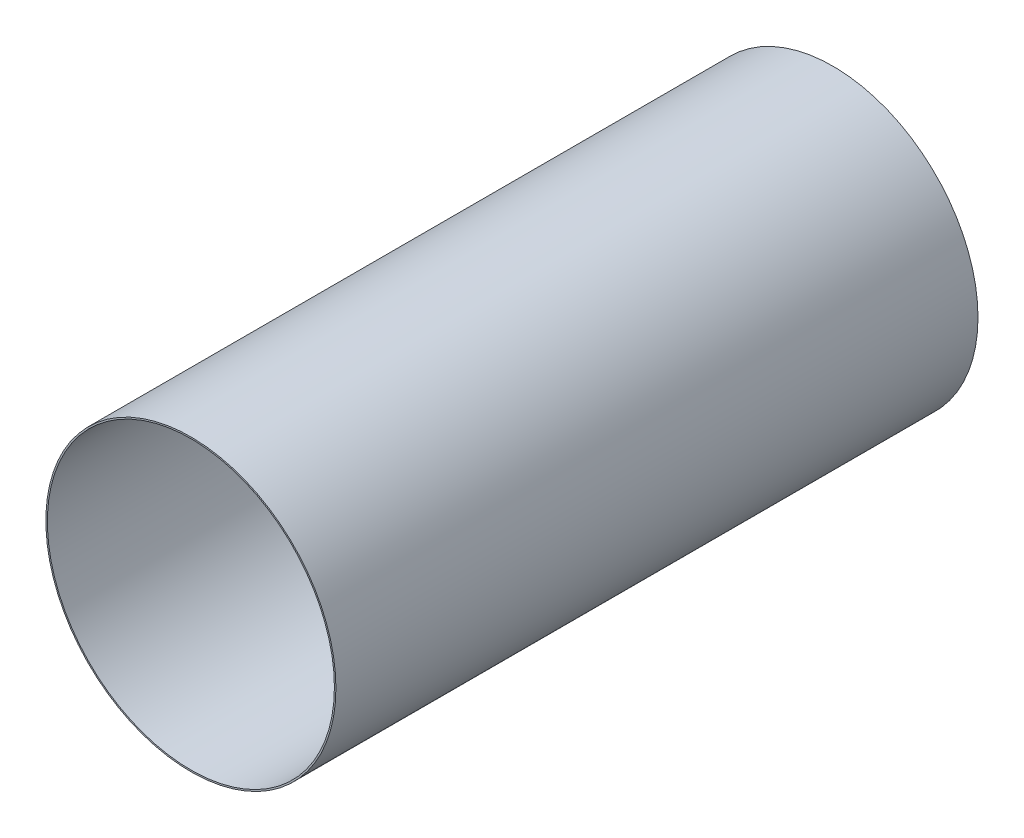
from build123d import *

# Parameters (mm, degrees)
SKETCH1_R           = 19.2
SKETCH1_R_2         = 19
BOSS_EXTRUDE1_DEPTH = 85


with BuildPart() as part:
    # Sketch1 → Boss-Extrude1 (new body)
    with BuildSketch(Plane.XY):
        Circle(SKETCH1_R)
        Circle(SKETCH1_R_2, mode=Mode.SUBTRACT)
    extrude(amount=-BOSS_EXTRUDE1_DEPTH)


solid = part.part
